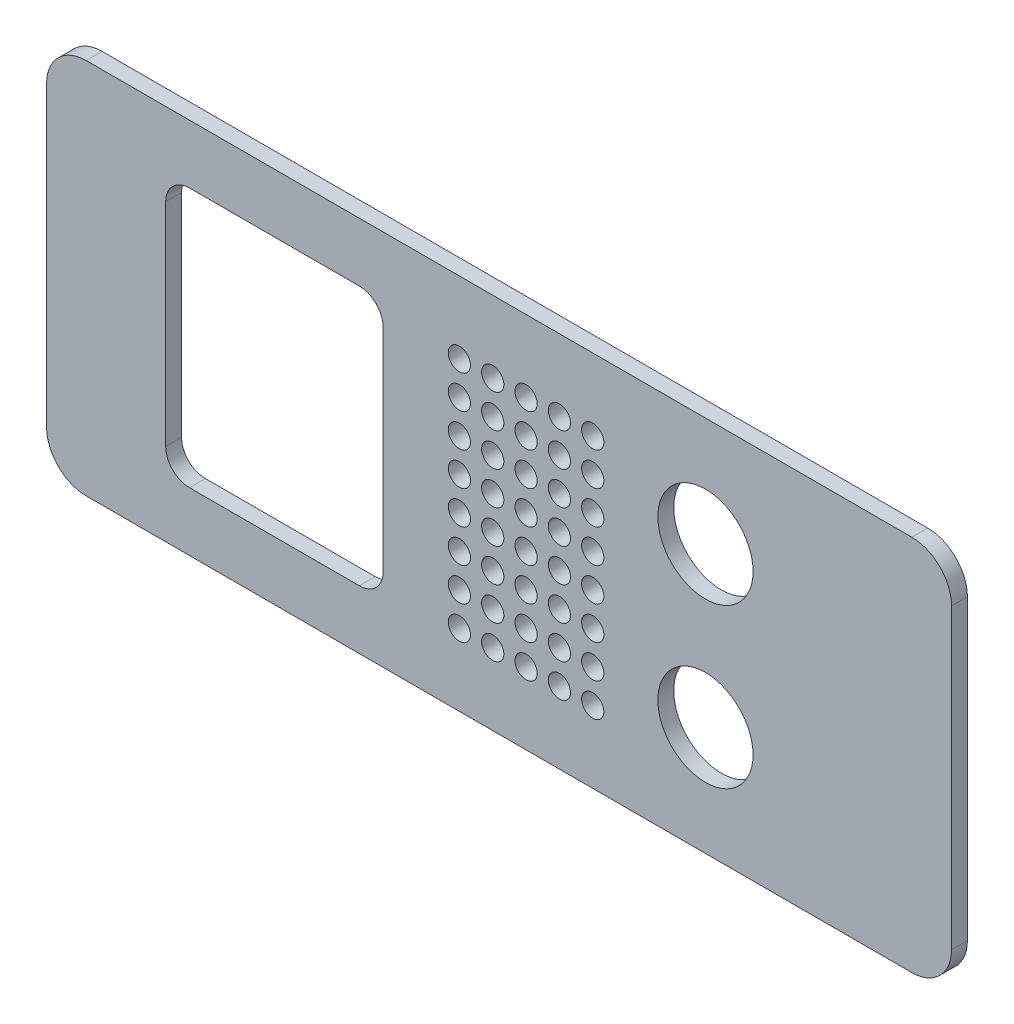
from build123d import *

# Parameters (mm, degrees)
SKETCH1_R           = 1.4
SKETCH1_R_2         = 6
BOSS_EXTRUDE1_DEPTH = 2


with BuildPart() as part:
    # Sketch1 → Boss-Extrude1 (new body)
    with BuildSketch(Plane.XY):
        with BuildLine():
            Line((-52, 23.75), (52, 23.75))
            ThreePointArc((52, 23.75), (55.535533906, 22.285533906), (57, 18.75))
            Line((57, 18.75), (57, -18.75))
            ThreePointArc((57, -18.75), (55.535533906, -22.285533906), (52, -23.75))
            Line((52, -23.75), (-52, -23.75))
            ThreePointArc((-52, -23.75), (-55.535533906, -22.285533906), (-57, -18.75))
            Line((-57, -18.75), (-57, 18.75))
            ThreePointArc((-57, 18.75), (-55.535533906, 22.285533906), (-52, 23.75))
        make_face()
        with Locations((-5, -14.7)):
            Circle(SKETCH1_R, mode=Mode.SUBTRACT)
        with Locations((-0.8, -14.7)):
            Circle(SKETCH1_R, mode=Mode.SUBTRACT)
        with Locations((3.4, -14.7)):
            Circle(SKETCH1_R, mode=Mode.SUBTRACT)
        with Locations((7.6, -14.7)):
            Circle(SKETCH1_R, mode=Mode.SUBTRACT)
        with Locations((11.8, -14.7)):
            Circle(SKETCH1_R, mode=Mode.SUBTRACT)
        with Locations((-5, -10.5)):
            Circle(SKETCH1_R, mode=Mode.SUBTRACT)
        with Locations((-0.8, -10.5)):
            Circle(SKETCH1_R, mode=Mode.SUBTRACT)
        with Locations((3.4, -10.5)):
            Circle(SKETCH1_R, mode=Mode.SUBTRACT)
        with Locations((7.6, -10.5)):
            Circle(SKETCH1_R, mode=Mode.SUBTRACT)
        with Locations((11.8, -10.5)):
            Circle(SKETCH1_R, mode=Mode.SUBTRACT)
        with Locations((-5, -6.3)):
            Circle(SKETCH1_R, mode=Mode.SUBTRACT)
        with Locations((-0.8, -6.3)):
            Circle(SKETCH1_R, mode=Mode.SUBTRACT)
        with Locations((3.4, -6.3)):
            Circle(SKETCH1_R, mode=Mode.SUBTRACT)
        with Locations((7.6, -6.3)):
            Circle(SKETCH1_R, mode=Mode.SUBTRACT)
        with Locations((11.8, -6.3)):
            Circle(SKETCH1_R, mode=Mode.SUBTRACT)
        with Locations((-5, -2.1)):
            Circle(SKETCH1_R, mode=Mode.SUBTRACT)
        with Locations((-0.8, -2.1)):
            Circle(SKETCH1_R, mode=Mode.SUBTRACT)
        with Locations((3.4, -2.1)):
            Circle(SKETCH1_R, mode=Mode.SUBTRACT)
        with Locations((7.6, -2.1)):
            Circle(SKETCH1_R, mode=Mode.SUBTRACT)
        with Locations((11.8, -2.1)):
            Circle(SKETCH1_R, mode=Mode.SUBTRACT)
        with Locations((-5, 2.1)):
            Circle(SKETCH1_R, mode=Mode.SUBTRACT)
        with Locations((-0.8, 2.1)):
            Circle(SKETCH1_R, mode=Mode.SUBTRACT)
        with Locations((3.4, 2.1)):
            Circle(SKETCH1_R, mode=Mode.SUBTRACT)
        with Locations((7.6, 2.1)):
            Circle(SKETCH1_R, mode=Mode.SUBTRACT)
        with Locations((11.8, 2.1)):
            Circle(SKETCH1_R, mode=Mode.SUBTRACT)
        with Locations((-5, 6.3)):
            Circle(SKETCH1_R, mode=Mode.SUBTRACT)
        with Locations((-0.8, 6.3)):
            Circle(SKETCH1_R, mode=Mode.SUBTRACT)
        with Locations((3.4, 6.3)):
            Circle(SKETCH1_R, mode=Mode.SUBTRACT)
        with Locations((7.6, 6.3)):
            Circle(SKETCH1_R, mode=Mode.SUBTRACT)
        with Locations((11.8, 6.3)):
            Circle(SKETCH1_R, mode=Mode.SUBTRACT)
        with Locations((-5, 10.5)):
            Circle(SKETCH1_R, mode=Mode.SUBTRACT)
        with Locations((-0.8, 10.5)):
            Circle(SKETCH1_R, mode=Mode.SUBTRACT)
        with Locations((3.4, 10.5)):
            Circle(SKETCH1_R, mode=Mode.SUBTRACT)
        with Locations((7.6, 10.5)):
            Circle(SKETCH1_R, mode=Mode.SUBTRACT)
        with Locations((11.8, 10.5)):
            Circle(SKETCH1_R, mode=Mode.SUBTRACT)
        with Locations((-5, 14.7)):
            Circle(SKETCH1_R, mode=Mode.SUBTRACT)
        with Locations((-0.8, 14.7)):
            Circle(SKETCH1_R, mode=Mode.SUBTRACT)
        with Locations((3.4, 14.7)):
            Circle(SKETCH1_R, mode=Mode.SUBTRACT)
        with Locations((7.6, 14.7)):
            Circle(SKETCH1_R, mode=Mode.SUBTRACT)
        with Locations((11.8, 14.7)):
            Circle(SKETCH1_R, mode=Mode.SUBTRACT)
        with Locations((26, -10)):
            Circle(SKETCH1_R_2, mode=Mode.SUBTRACT)
        with Locations((26, 10)):
            Circle(SKETCH1_R_2, mode=Mode.SUBTRACT)
        with BuildLine():
            Line((-39, 16.35), (-17.6, 16.35))
            ThreePointArc((-17.6, 16.35), (-15.478679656, 15.471320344), (-14.6, 13.35))
            Line((-14.6, 13.35), (-14.6, -13.35))
            ThreePointArc((-14.6, -13.35), (-15.478679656, -15.471320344), (-17.6, -16.35))
            Line((-17.6, -16.35), (-39, -16.35))
            ThreePointArc((-39, -16.35), (-41.121320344, -15.471320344), (-42, -13.35))
            Line((-42, -13.35), (-42, 13.35))
            ThreePointArc((-42, 13.35), (-41.121320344, 15.471320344), (-39, 16.35))
        make_face(mode=Mode.SUBTRACT)
    extrude(amount=BOSS_EXTRUDE1_DEPTH)


solid = part.part
